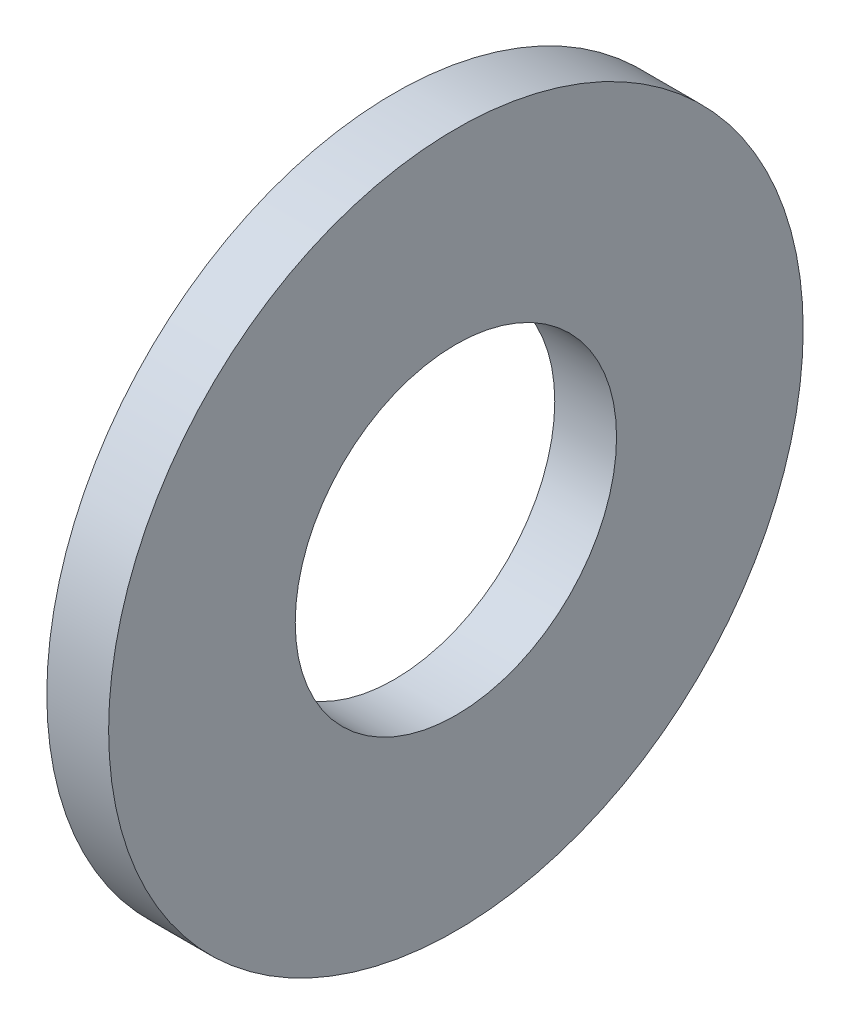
from build123d import *

# Parameters (mm, degrees)
SKETCH1_R           = 7.1374
SKETCH1_R_2         = 3.302
BOSS_EXTRUDE1_DEPTH = 1.27


with BuildPart() as part:
    # Sketch1 → Boss-Extrude1 (new body)
    with BuildSketch(Plane(origin=(0, 0, 0), x_dir=(0, 0, -1), z_dir=(1, 0, 0))):
        Circle(SKETCH1_R)
        Circle(SKETCH1_R_2, mode=Mode.SUBTRACT)
    extrude(amount=BOSS_EXTRUDE1_DEPTH)


solid = part.part
